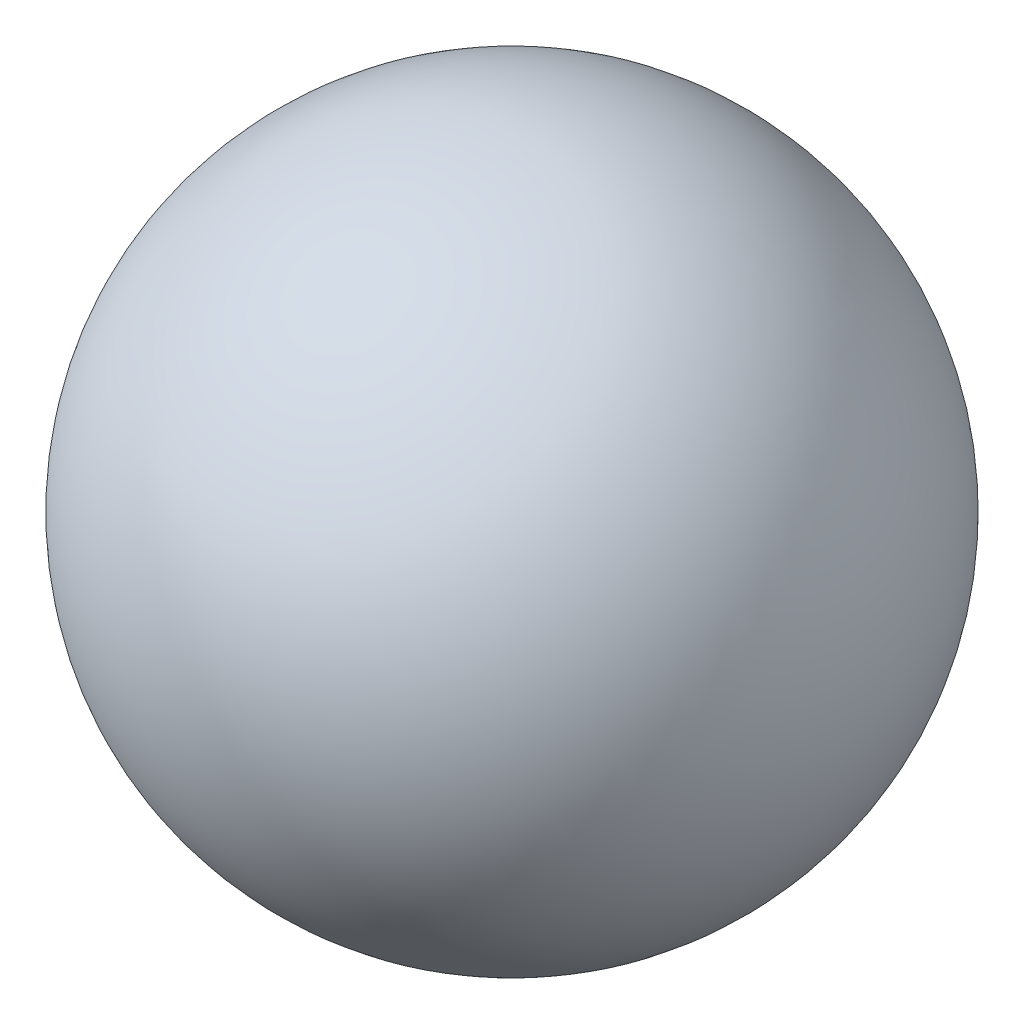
ISO-10303-21;
HEADER;
FILE_DESCRIPTION(('STEP AP214'),'2;1');
FILE_NAME('part.step','',(''),(''),'','','');
FILE_SCHEMA(('AUTOMOTIVE_DESIGN { 1 0 10303 214 1 1 1 1 }'));
ENDSEC;
DATA;
#1=APPLICATION_CONTEXT('core data for automotive mechanical design processes');
#2=APPLICATION_PROTOCOL_DEFINITION('international standard','automotive_design',2000,#1);
#3=PRODUCT_CONTEXT('',#1,'mechanical');
#4=PRODUCT('Part','Part','',(#3));
#5=PRODUCT_RELATED_PRODUCT_CATEGORY('part','',(#4));
#6=PRODUCT_DEFINITION_FORMATION('','',#4);
#7=PRODUCT_DEFINITION_CONTEXT('part definition',#1,'design');
#8=PRODUCT_DEFINITION('design','',#6,#7);
#9=PRODUCT_DEFINITION_SHAPE('','',#8);
#10=(LENGTH_UNIT() NAMED_UNIT(*) SI_UNIT(.MILLI.,.METRE.));
#11=(NAMED_UNIT(*) PLANE_ANGLE_UNIT() SI_UNIT($,.RADIAN.));
#12=(NAMED_UNIT(*) SI_UNIT($,.STERADIAN.) SOLID_ANGLE_UNIT());
#13=UNCERTAINTY_MEASURE_WITH_UNIT(LENGTH_MEASURE(1.E-05),#10,'distance_accuracy_value','');
#14=(GEOMETRIC_REPRESENTATION_CONTEXT(3) GLOBAL_UNCERTAINTY_ASSIGNED_CONTEXT((#13)) GLOBAL_UNIT_ASSIGNED_CONTEXT((#10,
#11,#12)) REPRESENTATION_CONTEXT('',''));
#15=CARTESIAN_POINT('',(0.,0.,0.));
#16=DIRECTION('',(0.,0.,1.));
#17=DIRECTION('',(1.,0.,0.));
#18=AXIS2_PLACEMENT_3D('',#15,#16,#17);
#19=CARTESIAN_POINT('',(0.,0.,0.));
#20=DIRECTION('',(0.,-1.,0.));
#21=DIRECTION('',(1.,0.,0.));
#22=AXIS2_PLACEMENT_3D('',#19,#20,#21);
#23=SPHERICAL_SURFACE('',#22,4.65);
#24=CARTESIAN_POINT('',(0.,-4.65,0.));
#25=VERTEX_POINT('',#24);
#26=VERTEX_LOOP('',#25);
#27=FACE_BOUND('',#26,.T.);
#28=ADVANCED_FACE('F30',(#27),#23,.T.);
#29=CLOSED_SHELL('',(#28));
#30=MANIFOLD_SOLID_BREP('B2',#29);
#31=ADVANCED_BREP_SHAPE_REPRESENTATION('',(#18,#30),#14);
#32=SHAPE_DEFINITION_REPRESENTATION(#9,#31);
ENDSEC;
END-ISO-10303-21;
